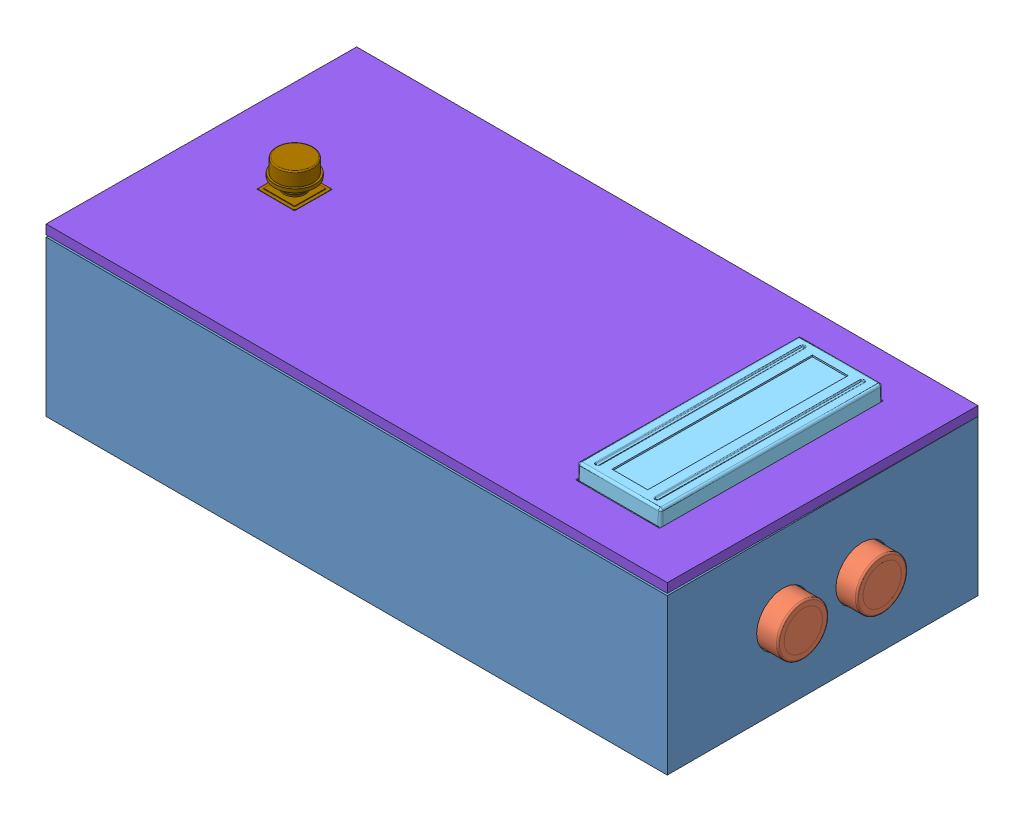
SolidWorks assembly Remote Assembly.SLDASM, configuration Default (file format 11000). Lengths in mm.
Overall size (206.54 62.36 100.02).
9 component instances, 9 part files, 22 mates.
Components (placement in the parent):
- Body-1: Body.SLDPRT [Default] at (-12.6407 -11.9617 -35.2031) size (200 50 100)
- Ultrasonic Sensor-1: Ultrasonic Sensor.SLDPRT [Default] at (81.3593 -11.9617 14.8469) x (0 0 -1) z (0 -1 0) size (45.7 13.64 25.8)
- 9v battery cell-1: 9v battery cell.SLDPRT [Varsayılan] at (-109.6407 -31.9617 -2.2031) x (1 0 0) z (0 1 0) size (53.5 30 21.8)
- 9v Duracell Body-1: 9v Duracell Body.SLDPRT [Default] at (-89.8327 -11.1617 -17.7531) x (0 1 0) z (0 0 1) size (17.11 47.9 25.9)
- display with i2c-1: display with i2c.SLDPRT [Default] at (58.7593 11.8591 14.5555) x (0 0.006448 0.999979) z (-1 0 0) size (80.7 17.6 36)
- Arduino-1: Arduino.SLDPRT [預設] at (-69.1407 -33.9617 35.1469) size (74.8 12.5 53.3)
- ArduiNano on Mount-1: ArduiNano on Mount.SLDPRT [Default] at (0.8456 -30.2027 -11.3162) x (1 0 0) z (0 1 0) size (50 25 17)
- Cover-1: Cover.SLDPRT [Default] at (-12.6407 15.1831 64.7852) x (-1 0 0) z (0 -0.006448 -0.999979) size (200 3 100)
- Bouton_poussoire-1: Bouton_poussoire.SLDPRT [Default] at (-87.7007 13.3603 14.7359) x (-1 0 0) z (0 0.999979 -0.006448) size (20 13 14.1)
Mates (geometry in assembly coordinates):
- Coincident1: coincident: plane of assembly; plane of assembly; plane of Body-1 through (84.3593 -36.9617 64.7969) normal (-1 0 0); plane of Ultrasonic Sensor-1 through (84.3593 -3.8117 11.8469) normal (1 0 0)
- Concentric1: concentric: cylinder of assembly; cylinder of assembly; cylinder of Body-1 through (87.3593 -11.9617 27.5469) axis (-1 0 0) radius 8.5; cylinder of Ultrasonic Sensor-1 through (93.8993 -11.9617 27.5469) axis (-1 0 0) radius 8.15
- Parallel3: parallel: plane of assembly; plane of assembly; plane of Body-1 through (-112.6407 13.0383 64.7969) normal (0 1 0); plane of Ultrasonic Sensor-1 through (82.3593 -1.3117 -8.0031) normal (0 1 0)
- Coincident3: coincident: plane of assembly; plane of assembly; plane of Body-1 through (-112.6407 -33.9617 64.7969) normal (0 1 0); plane of 9v battery cell-1 through (-109.6407 -33.9617 -2.2031) normal (0 -1 0)
- Coincident4: coincident: plane of assembly; plane of assembly; plane of Body-1 through (-12.6407 -11.9617 -32.2031) normal (0 0 1); plane of 9v battery cell-1 through (-109.6407 -28.2617 -32.2031) normal (0 0 -1)
- Coincident5: coincident: plane of assembly; plane of assembly; plane of Body-1 through (-109.6407 -36.9617 64.7969) normal (1 0 0); plane of 9v battery cell-1 through (-109.6407 -28.2617 -2.2031) normal (-1 0 0)
- Coincident6: coincident: plane of assembly; plane of assembly; plane of 9v battery cell-1 through (-109.6407 -28.2617 -2.2031) normal (0 1 0); plane of 9v Duracell Body-1 through (-59.3326 -28.2617 -6.8031) normal (0 -1 0)
- Coincident11: coincident: plane of assembly; plane of assembly; plane of 9v battery cell-1 through (-109.6407 -31.9617 -30.7031) normal (0 0 1); plane of 9v Duracell Body-1 through (-103.8327 -26.2617 -30.7031) normal (0 0 -1)
- Coincident12: coincident: plane of assembly; plane of assembly; plane of Body-1 through (-112.6407 -33.9617 64.7969) normal (0 1 0); plane of Arduino-1 through (-69.1407 -33.9617 35.1469) normal (0 -1 0)
- Coincident13: coincident: plane of assembly; plane of assembly; plane of Body-1 through (-12.6407 -11.9617 61.7969) normal (0 0 -1); plane of Arduino-1 through (-103.4407 -32.3617 61.7969) normal (0 0 1)
- Coincident14: coincident: plane of assembly; plane of assembly; plane of Body-1 through (-109.6407 -36.9617 64.7969) normal (1 0 0); plane of Arduino-1 through (-109.6407 -21.4617 18.0969) normal (-1 0 0)
- Coincident15: coincident: plane of assembly; plane of assembly; plane of Body-1 through (-112.6407 -33.9617 64.7969) normal (0 1 0); plane of ArduiNano on Mount-1 through (-9.8407 -33.9617 -19.7031) normal (0 -1 0)
- Coincident16: coincident: plane of assembly; plane of assembly; plane of Body-1 through (-12.6407 -11.9617 -32.2031) normal (0 0 1); plane of ArduiNano on Mount-1 through (-9.8407 -33.9617 -32.2031) normal (0 0 -1)
- Coincident19: coincident: plane of assembly; plane of assembly; plane of Arduino-1 through (-34.8407 -32.3617 23.8969) normal (1 0 0); plane of ArduiNano on Mount-1 through (-34.8407 -33.9617 -19.7031) normal (-1 0 0)
- Coincident20: coincident: plane of assembly; plane of assembly; plane of display with i2c-1 through (43.8593 -63.2275 -20.711) normal (-1 0 0); plane of Cover-1 through (43.8593 -83.8694 -20.578) normal (1 0 0)
- Coincident21: coincident: plane of assembly; plane of assembly; plane of display with i2c-1 through (70.6593 -63.2275 -20.711) normal (0 -0.006448 -0.999979); plane of Cover-1 through (43.8593 -83.8694 -20.578) normal (0 0.006448 0.999979)
- Coincident22: coincident: plane of assembly; plane of assembly; plane of display with i2c-1 through (58.7593 13.3591 14.5459) normal (0 0.999979 -0.006448); plane of Cover-1 through (87.3593 13.0383 -35.2031) normal (0 -0.999979 0.006448)
- Coincident23: coincident: plane of assembly; plane of assembly; plane of Cover-1 through (-88.7007 -83.6764 9.3614) normal (1 0 0); plane of Bouton_poussoire-1 through (-88.7007 16.3957 20.2164) normal (-1 0 0)
- Coincident24: coincident: plane of assembly; plane of assembly; plane of Cover-1 through (-76.5807 -83.6764 9.3614) normal (0 0.006448 0.999979); plane of Bouton_poussoire-1 through (-77.2007 16.3216 8.7167) normal (0 -0.006448 -0.999979)
- Coincident25: coincident: plane of assembly; plane of assembly; plane of Cover-1 through (87.3593 13.0383 -35.2031) normal (0 -0.999979 0.006448); plane of Bouton_poussoire-1 through (-87.7007 13.3603 14.7359) normal (0 0.999979 -0.006448)
- Coincident28: coincident: plane of assembly; plane of assembly; plane of Body-1 through (-112.6407 -36.9617 64.7969) normal (-1 0 0); plane of Cover-1 through (-112.6407 13.0383 -35.2031) normal (-1 0 0)
- Coincident29: coincident: line of assembly; line of assembly; line of Body-1 through (87.3593 13.0383 -35.2031) axis (-1 0 0); line of Cover-1 through (87.3593 13.0383 -35.2031) axis (-1 0 0)
